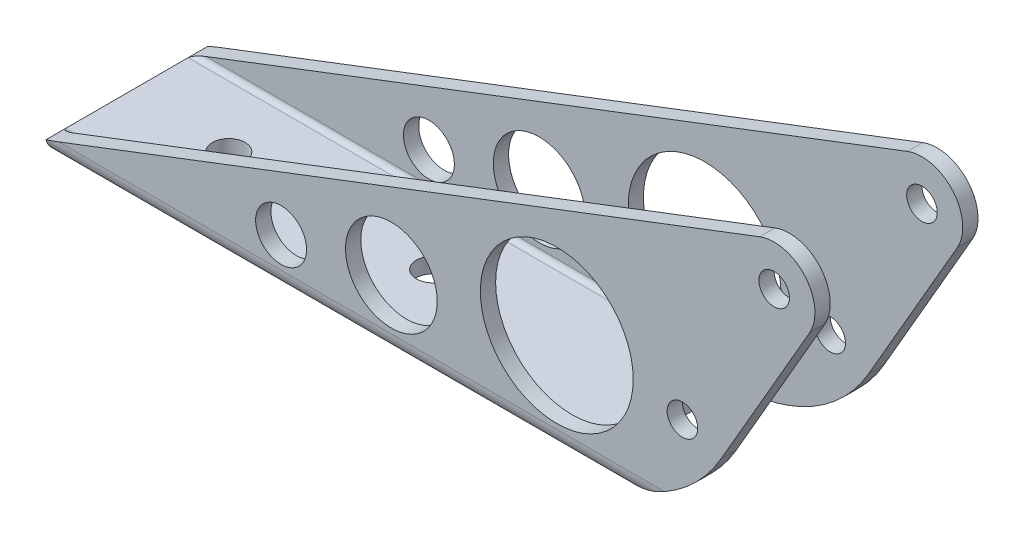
from build123d import *

# Parameters (mm, degrees)
TOLE_DEPTH              = 160
DECOUPE_DEPTH           = 172.627503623
DECOUPE_DEPTH_BACK      = 172.627503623
ESQUISSE4_OUTSIDE_W     = 196.77
ESQUISSE4_OUTSIDE_H     = 96.77
ESQUISSE5_W             = 43.403411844
ESQUISSE5_H             = 26
DEGAGEMENT_DEPTH        = 163.253503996
ESQUISSE6_R             = 5
ESQUISSE6_R_2           = 9
ESQUISSE6_R_3           = 15
ENL_V_MAT_EXTRU_3_DEPTH = 165.603157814
PASSAGE_AXE_D           = 6
PASSAGE_M6_D            = 6.4


with BuildPart() as part:
    # Esquisse2 → TOLE (new body)
    with BuildSketch(Plane(origin=(0, 0, 0), x_dir=(0, 0, -1), z_dir=(1, 0, 0))):
        with BuildLine():
            Line((-16, 60), (-16, 4))
            ThreePointArc((-16, 4), (-14.828427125, 1.171572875), (-12, 0))
            Line((-12, 0), (12, 0))
            ThreePointArc((12, 0), (14.828427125, 1.171572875), (16, 4))
            Line((16, 4), (16, 60))
            Line((16, 60), (13, 60))
            Line((13, 60), (13, 4))
            ThreePointArc((13, 4), (12.707106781, 3.292893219), (12, 3))
            Line((12, 3), (-12, 3))
            ThreePointArc((-12, 3), (-12.707106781, 3.292893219), (-13, 4))
            Line((-13, 4), (-13, 60))
            Line((-13, 60), (-16, 60))
        make_face()
    extrude(amount=TOLE_DEPTH)

    # Esquisse4 outside → DECOUPE (cut, two sides: drawn at the far end of the back side and taken through both)
    with BuildSketch(Plane.XY.offset(-DECOUPE_DEPTH_BACK)):
        with Locations((80, 30)):
            Rectangle(ESQUISSE4_OUTSIDE_W, ESQUISSE4_OUTSIDE_H)
        with BuildLine():
            Line((0, 0), (106.524791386, 0))
            ThreePointArc((106.524791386, 0), (121.524791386, 4.019237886), (132.505553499, 15))
            Line((132.505553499, 15), (149.92820323, 45.176914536))
            ThreePointArc((149.92820323, 45.176914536), (149.085614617, 54.369726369), (140.139864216, 56.648167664))
            Line((140.139864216, 56.648167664), (0, 3))
            Line((0, 3), (0, 0))
        make_face(mode=Mode.SUBTRACT)
    extrude(amount=DECOUPE_DEPTH + DECOUPE_DEPTH_BACK, mode=Mode.SUBTRACT)

    # Esquisse5 → DEGAGEMENT (cut, through all)
    with BuildSketch(Plane.XZ):
        with Locations((128.226497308, 0)):
            Rectangle(ESQUISSE5_W, ESQUISSE5_H)
    extrude(amount=-DEGAGEMENT_DEPTH, mode=Mode.SUBTRACT)

    # Esquisse6 → Enl_v. mat.-Extru.3 (cut, through all)
    with BuildSketch(Plane.XY.offset(16)):
        with Locations((46.256115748, 10)):
            Circle(ESQUISSE6_R)
        with Locations((67.893204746, 14)):
            Circle(ESQUISSE6_R_2)
        with Locations((100.348838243, 20)):
            Circle(ESQUISSE6_R_3)
    extrude(amount=-ENL_V_MAT_EXTRU_3_DEPTH, mode=Mode.SUBTRACT)

    # PASSAGE AXE (through all)
    with Locations(Plane.XY.offset(16)):
        with Locations((143, 49.176914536), (125, 18)):
            Hole(PASSAGE_AXE_D / 2)

    # PASSAGE M6 (through all)
    with Locations(Plane(origin=(20, 0, 0), x_dir=(0, 0, -1), z_dir=(0, -1, 0))):
        with Locations((0, 0), (0, 40)):
            Hole(PASSAGE_M6_D / 2)


solid = part.part
